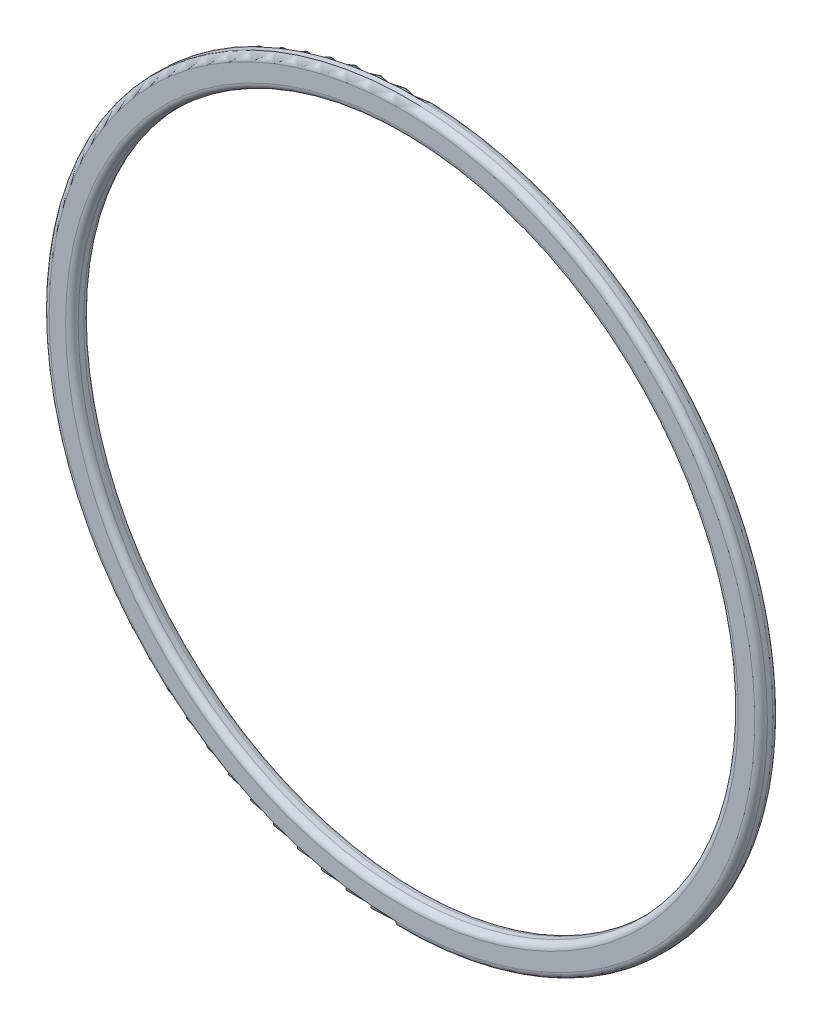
ISO-10303-21;
HEADER;
FILE_DESCRIPTION(('STEP AP214'),'2;1');
FILE_NAME('part.step','',(''),(''),'','','');
FILE_SCHEMA(('AUTOMOTIVE_DESIGN { 1 0 10303 214 1 1 1 1 }'));
ENDSEC;
DATA;
#1=APPLICATION_CONTEXT('core data for automotive mechanical design processes');
#2=APPLICATION_PROTOCOL_DEFINITION('international standard','automotive_design',2000,#1);
#3=PRODUCT_CONTEXT('',#1,'mechanical');
#4=PRODUCT('Part','Part','',(#3));
#5=PRODUCT_RELATED_PRODUCT_CATEGORY('part','',(#4));
#6=PRODUCT_DEFINITION_FORMATION('','',#4);
#7=PRODUCT_DEFINITION_CONTEXT('part definition',#1,'design');
#8=PRODUCT_DEFINITION('design','',#6,#7);
#9=PRODUCT_DEFINITION_SHAPE('','',#8);
#10=(LENGTH_UNIT() NAMED_UNIT(*) SI_UNIT(.MILLI.,.METRE.));
#11=(NAMED_UNIT(*) PLANE_ANGLE_UNIT() SI_UNIT($,.RADIAN.));
#12=(NAMED_UNIT(*) SI_UNIT($,.STERADIAN.) SOLID_ANGLE_UNIT());
#13=UNCERTAINTY_MEASURE_WITH_UNIT(LENGTH_MEASURE(1.E-05),#10,'distance_accuracy_value','');
#14=(GEOMETRIC_REPRESENTATION_CONTEXT(3) GLOBAL_UNCERTAINTY_ASSIGNED_CONTEXT((#13)) GLOBAL_UNIT_ASSIGNED_CONTEXT((#10,
#11,#12)) REPRESENTATION_CONTEXT('',''));
#15=CARTESIAN_POINT('',(0.,0.,0.));
#16=DIRECTION('',(0.,0.,1.));
#17=DIRECTION('',(1.,0.,0.));
#18=AXIS2_PLACEMENT_3D('',#15,#16,#17);
#19=CARTESIAN_POINT('',(0.,0.,-0.228488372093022));
#20=DIRECTION('',(0.,0.,-1.));
#21=DIRECTION('',(-1.,0.,0.));
#22=AXIS2_PLACEMENT_3D('',#19,#20,#21);
#23=TOROIDAL_SURFACE('',#22,21.4,0.400000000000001);
#24=CARTESIAN_POINT('',(0.,0.,-0.628488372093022));
#25=DIRECTION('',(0.,0.,-1.));
#26=DIRECTION('',(-1.,0.,0.));
#27=AXIS2_PLACEMENT_3D('',#24,#25,#26);
#28=CIRCLE('',#27,21.4);
#29=CARTESIAN_POINT('',(-21.4,0.,-0.628488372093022));
#30=VERTEX_POINT('',#29);
#31=EDGE_CURVE('E10',#30,#30,#28,.T.);
#32=ORIENTED_EDGE('',*,*,#31,.T.);
#33=EDGE_LOOP('',(#32));
#34=FACE_BOUND('',#33,.T.);
#35=CARTESIAN_POINT('',(0.,0.,-0.228488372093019));
#36=DIRECTION('',(0.,0.,-1.));
#37=DIRECTION('',(-1.,0.,0.));
#38=AXIS2_PLACEMENT_3D('',#35,#36,#37);
#39=CIRCLE('',#38,21.);
#40=CARTESIAN_POINT('',(-21.,0.,-0.228488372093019));
#41=VERTEX_POINT('',#40);
#42=EDGE_CURVE('E63',#41,#41,#39,.T.);
#43=ORIENTED_EDGE('',*,*,#42,.F.);
#44=EDGE_LOOP('',(#43));
#45=FACE_BOUND('',#44,.T.);
#46=ADVANCED_FACE('F35',(#34,#45),#23,.T.);
#47=CARTESIAN_POINT('',(-22.45,0.,-0.62848837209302));
#48=DIRECTION('',(0.,0.,-1.));
#49=DIRECTION('',(-1.,0.,0.));
#50=AXIS2_PLACEMENT_3D('',#47,#48,#49);
#51=PLANE('',#50);
#52=CARTESIAN_POINT('',(0.,0.,-0.628488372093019));
#53=DIRECTION('',(0.,0.,-1.));
#54=DIRECTION('',(-1.,0.,0.));
#55=AXIS2_PLACEMENT_3D('',#52,#53,#54);
#56=CIRCLE('',#55,22.45);
#57=CARTESIAN_POINT('',(-22.45,0.,-0.628488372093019));
#58=VERTEX_POINT('',#57);
#59=EDGE_CURVE('E41',#58,#58,#56,.T.);
#60=ORIENTED_EDGE('',*,*,#59,.T.);
#61=EDGE_LOOP('',(#60));
#62=FACE_BOUND('',#61,.T.);
#63=ORIENTED_EDGE('',*,*,#31,.F.);
#64=EDGE_LOOP('',(#63));
#65=FACE_BOUND('',#64,.T.);
#66=ADVANCED_FACE('F71',(#62,#65),#51,.T.);
#67=CARTESIAN_POINT('',(0.,0.,-0.228488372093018));
#68=DIRECTION('',(0.,0.,-1.));
#69=DIRECTION('',(-1.,0.,0.));
#70=AXIS2_PLACEMENT_3D('',#67,#68,#69);
#71=TOROIDAL_SURFACE('',#70,22.45,0.400000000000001);
#72=CARTESIAN_POINT('',(0.,0.,-0.228488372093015));
#73=DIRECTION('',(0.,0.,-1.));
#74=DIRECTION('',(-1.,0.,0.));
#75=AXIS2_PLACEMENT_3D('',#72,#73,#74);
#76=CIRCLE('',#75,22.85);
#77=CARTESIAN_POINT('',(-22.85,0.,-0.228488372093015));
#78=VERTEX_POINT('',#77);
#79=EDGE_CURVE('E45',#78,#78,#76,.T.);
#80=ORIENTED_EDGE('',*,*,#79,.T.);
#81=EDGE_LOOP('',(#80));
#82=FACE_BOUND('',#81,.T.);
#83=ORIENTED_EDGE('',*,*,#59,.F.);
#84=EDGE_LOOP('',(#83));
#85=FACE_BOUND('',#84,.T.);
#86=ADVANCED_FACE('F75',(#82,#85),#71,.T.);
#87=CARTESIAN_POINT('',(0.,0.,0.));
#88=DIRECTION('',(0.,0.,-1.));
#89=DIRECTION('',(-1.,0.,0.));
#90=AXIS2_PLACEMENT_3D('',#87,#88,#89);
#91=CYLINDRICAL_SURFACE('',#90,22.85);
#92=CARTESIAN_POINT('',(0.,0.,0.121511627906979));
#93=DIRECTION('',(0.,0.,-1.));
#94=DIRECTION('',(-1.,0.,0.));
#95=AXIS2_PLACEMENT_3D('',#92,#93,#94);
#96=CIRCLE('',#95,22.85);
#97=CARTESIAN_POINT('',(-22.85,0.,0.121511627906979));
#98=VERTEX_POINT('',#97);
#99=EDGE_CURVE('E49',#98,#98,#96,.T.);
#100=ORIENTED_EDGE('',*,*,#99,.T.);
#101=EDGE_LOOP('',(#100));
#102=FACE_BOUND('',#101,.T.);
#103=ORIENTED_EDGE('',*,*,#79,.F.);
#104=EDGE_LOOP('',(#103));
#105=FACE_BOUND('',#104,.T.);
#106=ADVANCED_FACE('F79',(#102,#105),#91,.T.);
#107=CARTESIAN_POINT('',(0.,0.,0.121511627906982));
#108=DIRECTION('',(0.,0.,-1.));
#109=DIRECTION('',(-1.,0.,0.));
#110=AXIS2_PLACEMENT_3D('',#107,#108,#109);
#111=TOROIDAL_SURFACE('',#110,22.45,0.400000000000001);
#112=CARTESIAN_POINT('',(0.,0.,0.521511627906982));
#113=DIRECTION('',(0.,0.,-1.));
#114=DIRECTION('',(-1.,0.,0.));
#115=AXIS2_PLACEMENT_3D('',#112,#113,#114);
#116=CIRCLE('',#115,22.45);
#117=CARTESIAN_POINT('',(-22.45,0.,0.521511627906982));
#118=VERTEX_POINT('',#117);
#119=EDGE_CURVE('E54',#118,#118,#116,.T.);
#120=ORIENTED_EDGE('',*,*,#119,.T.);
#121=EDGE_LOOP('',(#120));
#122=FACE_BOUND('',#121,.T.);
#123=ORIENTED_EDGE('',*,*,#99,.F.);
#124=EDGE_LOOP('',(#123));
#125=FACE_BOUND('',#124,.T.);
#126=ADVANCED_FACE('F86',(#122,#125),#111,.T.);
#127=CARTESIAN_POINT('',(-22.45,0.,0.52151162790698));
#128=DIRECTION('',(0.,0.,1.));
#129=DIRECTION('',(1.,0.,0.));
#130=AXIS2_PLACEMENT_3D('',#127,#128,#129);
#131=PLANE('',#130);
#132=CARTESIAN_POINT('',(0.,0.,0.521511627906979));
#133=DIRECTION('',(0.,0.,-1.));
#134=DIRECTION('',(-1.,0.,0.));
#135=AXIS2_PLACEMENT_3D('',#132,#133,#134);
#136=CIRCLE('',#135,21.4);
#137=CARTESIAN_POINT('',(-21.4,0.,0.521511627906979));
#138=VERTEX_POINT('',#137);
#139=EDGE_CURVE('E57',#138,#138,#136,.T.);
#140=ORIENTED_EDGE('',*,*,#139,.T.);
#141=EDGE_LOOP('',(#140));
#142=FACE_BOUND('',#141,.T.);
#143=ORIENTED_EDGE('',*,*,#119,.F.);
#144=EDGE_LOOP('',(#143));
#145=FACE_BOUND('',#144,.T.);
#146=ADVANCED_FACE('F90',(#142,#145),#131,.T.);
#147=CARTESIAN_POINT('',(0.,0.,0.121511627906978));
#148=DIRECTION('',(0.,0.,-1.));
#149=DIRECTION('',(-1.,0.,0.));
#150=AXIS2_PLACEMENT_3D('',#147,#148,#149);
#151=TOROIDAL_SURFACE('',#150,21.4,0.400000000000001);
#152=CARTESIAN_POINT('',(0.,0.,0.121511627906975));
#153=DIRECTION('',(0.,0.,-1.));
#154=DIRECTION('',(-1.,0.,0.));
#155=AXIS2_PLACEMENT_3D('',#152,#153,#154);
#156=CIRCLE('',#155,21.);
#157=CARTESIAN_POINT('',(-21.,0.,0.121511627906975));
#158=VERTEX_POINT('',#157);
#159=EDGE_CURVE('E60',#158,#158,#156,.T.);
#160=ORIENTED_EDGE('',*,*,#159,.T.);
#161=EDGE_LOOP('',(#160));
#162=FACE_BOUND('',#161,.T.);
#163=ORIENTED_EDGE('',*,*,#139,.F.);
#164=EDGE_LOOP('',(#163));
#165=FACE_BOUND('',#164,.T.);
#166=ADVANCED_FACE('F94',(#162,#165),#151,.T.);
#167=CARTESIAN_POINT('',(0.,0.,0.));
#168=DIRECTION('',(0.,0.,-1.));
#169=DIRECTION('',(-1.,0.,0.));
#170=AXIS2_PLACEMENT_3D('',#167,#168,#169);
#171=CYLINDRICAL_SURFACE('',#170,21.);
#172=ORIENTED_EDGE('',*,*,#42,.T.);
#173=EDGE_LOOP('',(#172));
#174=FACE_BOUND('',#173,.T.);
#175=ORIENTED_EDGE('',*,*,#159,.F.);
#176=EDGE_LOOP('',(#175));
#177=FACE_BOUND('',#176,.T.);
#178=ADVANCED_FACE('F67',(#174,#177),#171,.F.);
#179=CLOSED_SHELL('',(#46,#66,#86,#106,#126,#146,#166,#178));
#180=MANIFOLD_SOLID_BREP('B2',#179);
#181=ADVANCED_BREP_SHAPE_REPRESENTATION('',(#18,#180),#14);
#182=SHAPE_DEFINITION_REPRESENTATION(#9,#181);
ENDSEC;
END-ISO-10303-21;
